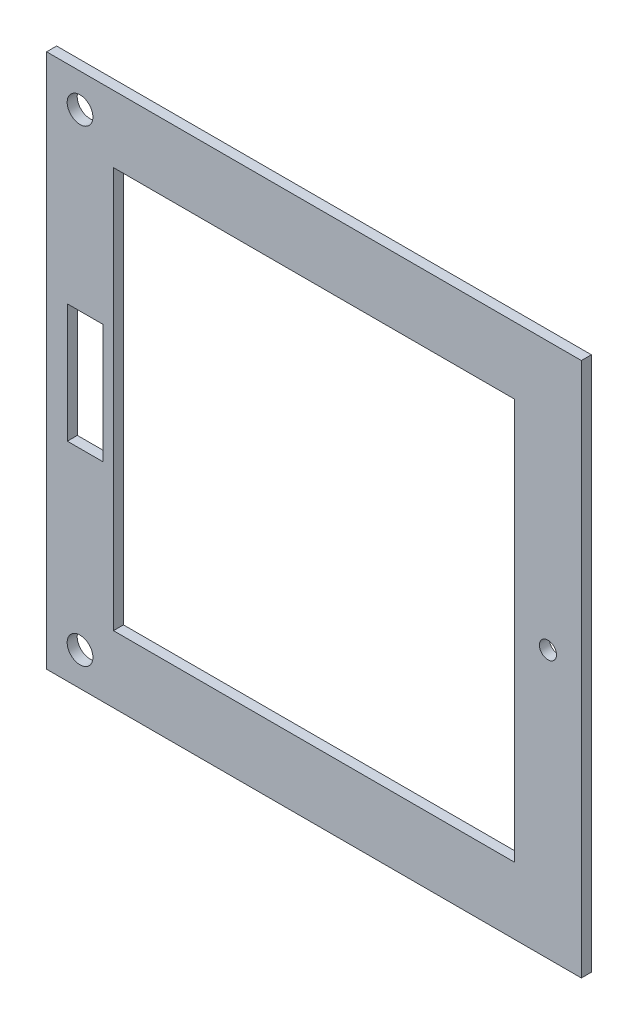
ISO-10303-21;
HEADER;
FILE_DESCRIPTION(('STEP AP214'),'2;1');
FILE_NAME('part.step','',(''),(''),'','','');
FILE_SCHEMA(('AUTOMOTIVE_DESIGN { 1 0 10303 214 1 1 1 1 }'));
ENDSEC;
DATA;
#1=APPLICATION_CONTEXT('core data for automotive mechanical design processes');
#2=APPLICATION_PROTOCOL_DEFINITION('international standard','automotive_design',2000,#1);
#3=PRODUCT_CONTEXT('',#1,'mechanical');
#4=PRODUCT('Part','Part','',(#3));
#5=PRODUCT_RELATED_PRODUCT_CATEGORY('part','',(#4));
#6=PRODUCT_DEFINITION_FORMATION('','',#4);
#7=PRODUCT_DEFINITION_CONTEXT('part definition',#1,'design');
#8=PRODUCT_DEFINITION('design','',#6,#7);
#9=PRODUCT_DEFINITION_SHAPE('','',#8);
#10=(LENGTH_UNIT() NAMED_UNIT(*) SI_UNIT(.MILLI.,.METRE.));
#11=(NAMED_UNIT(*) PLANE_ANGLE_UNIT() SI_UNIT($,.RADIAN.));
#12=(NAMED_UNIT(*) SI_UNIT($,.STERADIAN.) SOLID_ANGLE_UNIT());
#13=UNCERTAINTY_MEASURE_WITH_UNIT(LENGTH_MEASURE(1.E-05),#10,'distance_accuracy_value','');
#14=(GEOMETRIC_REPRESENTATION_CONTEXT(3) GLOBAL_UNCERTAINTY_ASSIGNED_CONTEXT((#13)) GLOBAL_UNIT_ASSIGNED_CONTEXT((#10,
#11,#12)) REPRESENTATION_CONTEXT('',''));
#15=CARTESIAN_POINT('',(0.,0.,0.));
#16=DIRECTION('',(0.,0.,1.));
#17=DIRECTION('',(1.,0.,0.));
#18=AXIS2_PLACEMENT_3D('',#15,#16,#17);
#19=CARTESIAN_POINT('',(0.,0.,6.));
#20=DIRECTION('',(0.,0.,-1.));
#21=DIRECTION('',(-1.,0.,0.));
#22=AXIS2_PLACEMENT_3D('',#19,#20,#21);
#23=PLANE('',#22);
#24=DIRECTION('',(1.,0.,0.));
#25=VECTOR('',#24,1.);
#26=CARTESIAN_POINT('',(-27.6,84.4,6.));
#27=LINE('',#26,#25);
#28=CARTESIAN_POINT('',(-27.6,84.4,6.));
#29=VERTEX_POINT('',#28);
#30=CARTESIAN_POINT('',(-6.40000000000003,84.4,6.));
#31=VERTEX_POINT('',#30);
#32=EDGE_CURVE('E149',#29,#31,#27,.T.);
#33=ORIENTED_EDGE('',*,*,#32,.F.);
#34=DIRECTION('',(0.,-1.,0.));
#35=VECTOR('',#34,1.);
#36=CARTESIAN_POINT('',(-27.6,155.6,6.));
#37=LINE('',#36,#35);
#38=CARTESIAN_POINT('',(-27.6,155.6,6.));
#39=VERTEX_POINT('',#38);
#40=EDGE_CURVE('E48',#39,#29,#37,.T.);
#41=ORIENTED_EDGE('',*,*,#40,.F.);
#42=DIRECTION('',(-1.,0.,0.));
#43=VECTOR('',#42,1.);
#44=CARTESIAN_POINT('',(-27.6,155.6,6.));
#45=LINE('',#44,#43);
#46=CARTESIAN_POINT('',(-6.40000000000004,155.6,6.));
#47=VERTEX_POINT('',#46);
#48=EDGE_CURVE('E140',#47,#39,#45,.T.);
#49=ORIENTED_EDGE('',*,*,#48,.F.);
#50=DIRECTION('',(0.,1.,0.));
#51=VECTOR('',#50,1.);
#52=CARTESIAN_POINT('',(-6.40000000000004,155.6,6.));
#53=LINE('',#52,#51);
#54=EDGE_CURVE('E143',#31,#47,#53,.T.);
#55=ORIENTED_EDGE('',*,*,#54,.F.);
#56=EDGE_LOOP('',(#33,#41,#49,#55));
#57=FACE_BOUND('',#56,.T.);
#58=CARTESIAN_POINT('',(-20.,-20.,6.));
#59=DIRECTION('',(0.,0.,1.));
#60=DIRECTION('',(1.,0.,0.));
#61=AXIS2_PLACEMENT_3D('',#58,#59,#60);
#62=CIRCLE('',#61,7.7);
#63=CARTESIAN_POINT('',(-12.3,-20.,6.));
#64=VERTEX_POINT('',#63);
#65=EDGE_CURVE('E155',#64,#64,#62,.T.);
#66=ORIENTED_EDGE('',*,*,#65,.F.);
#67=EDGE_LOOP('',(#66));
#68=FACE_BOUND('',#67,.T.);
#69=CARTESIAN_POINT('',(260.,120.,6.));
#70=DIRECTION('',(0.,0.,1.));
#71=DIRECTION('',(1.,0.,0.));
#72=AXIS2_PLACEMENT_3D('',#69,#70,#71);
#73=CIRCLE('',#72,5.09999999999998);
#74=CARTESIAN_POINT('',(265.1,120.,6.));
#75=VERTEX_POINT('',#74);
#76=EDGE_CURVE('E162',#75,#75,#73,.T.);
#77=ORIENTED_EDGE('',*,*,#76,.F.);
#78=EDGE_LOOP('',(#77));
#79=FACE_BOUND('',#78,.T.);
#80=CARTESIAN_POINT('',(-20.,260.,6.));
#81=DIRECTION('',(0.,0.,1.));
#82=DIRECTION('',(1.,0.,0.));
#83=AXIS2_PLACEMENT_3D('',#80,#81,#82);
#84=CIRCLE('',#83,7.69999999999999);
#85=CARTESIAN_POINT('',(-12.3,260.,6.));
#86=VERTEX_POINT('',#85);
#87=EDGE_CURVE('E168',#86,#86,#84,.T.);
#88=ORIENTED_EDGE('',*,*,#87,.F.);
#89=EDGE_LOOP('',(#88));
#90=FACE_BOUND('',#89,.T.);
#91=DIRECTION('',(0.,-1.,0.));
#92=VECTOR('',#91,1.);
#93=CARTESIAN_POINT('',(-40.,-40.,6.));
#94=LINE('',#93,#92);
#95=CARTESIAN_POINT('',(-40.,280.,6.));
#96=VERTEX_POINT('',#95);
#97=CARTESIAN_POINT('',(-40.,-40.,6.));
#98=VERTEX_POINT('',#97);
#99=EDGE_CURVE('E208',#96,#98,#94,.T.);
#100=ORIENTED_EDGE('',*,*,#99,.T.);
#101=DIRECTION('',(1.,0.,0.));
#102=VECTOR('',#101,1.);
#103=CARTESIAN_POINT('',(-40.,-40.,6.));
#104=LINE('',#103,#102);
#105=CARTESIAN_POINT('',(280.,-40.,6.));
#106=VERTEX_POINT('',#105);
#107=EDGE_CURVE('E211',#98,#106,#104,.T.);
#108=ORIENTED_EDGE('',*,*,#107,.T.);
#109=DIRECTION('',(0.,1.,0.));
#110=VECTOR('',#109,1.);
#111=CARTESIAN_POINT('',(280.,-40.,6.));
#112=LINE('',#111,#110);
#113=CARTESIAN_POINT('',(280.,280.,6.));
#114=VERTEX_POINT('',#113);
#115=EDGE_CURVE('E214',#106,#114,#112,.T.);
#116=ORIENTED_EDGE('',*,*,#115,.T.);
#117=DIRECTION('',(-1.,0.,0.));
#118=VECTOR('',#117,1.);
#119=CARTESIAN_POINT('',(-40.,280.,6.));
#120=LINE('',#119,#118);
#121=EDGE_CURVE('E216',#114,#96,#120,.T.);
#122=ORIENTED_EDGE('',*,*,#121,.T.);
#123=EDGE_LOOP('',(#100,#108,#116,#122));
#124=FACE_BOUND('',#123,.T.);
#125=DIRECTION('',(0.,-1.,0.));
#126=VECTOR('',#125,1.);
#127=CARTESIAN_POINT('',(0.,0.,6.));
#128=LINE('',#127,#126);
#129=CARTESIAN_POINT('',(0.,240.,6.));
#130=VERTEX_POINT('',#129);
#131=CARTESIAN_POINT('',(0.,0.,6.));
#132=VERTEX_POINT('',#131);
#133=EDGE_CURVE('E177',#130,#132,#128,.T.);
#134=ORIENTED_EDGE('',*,*,#133,.F.);
#135=DIRECTION('',(-1.,0.,0.));
#136=VECTOR('',#135,1.);
#137=CARTESIAN_POINT('',(0.,240.,6.));
#138=LINE('',#137,#136);
#139=CARTESIAN_POINT('',(240.,240.,6.));
#140=VERTEX_POINT('',#139);
#141=EDGE_CURVE('E185',#140,#130,#138,.T.);
#142=ORIENTED_EDGE('',*,*,#141,.F.);
#143=DIRECTION('',(0.,1.,0.));
#144=VECTOR('',#143,1.);
#145=CARTESIAN_POINT('',(240.,0.,6.));
#146=LINE('',#145,#144);
#147=CARTESIAN_POINT('',(240.,0.,6.));
#148=VERTEX_POINT('',#147);
#149=EDGE_CURVE('E182',#148,#140,#146,.T.);
#150=ORIENTED_EDGE('',*,*,#149,.F.);
#151=DIRECTION('',(1.,0.,0.));
#152=VECTOR('',#151,1.);
#153=CARTESIAN_POINT('',(0.,0.,6.));
#154=LINE('',#153,#152);
#155=EDGE_CURVE('E179',#132,#148,#154,.T.);
#156=ORIENTED_EDGE('',*,*,#155,.F.);
#157=EDGE_LOOP('',(#134,#142,#150,#156));
#158=FACE_BOUND('',#157,.T.);
#159=ADVANCED_FACE('F33',(#57,#68,#79,#90,#124,#158),#23,.F.);
#160=CARTESIAN_POINT('',(0.,0.,0.));
#161=DIRECTION('',(0.,0.,-1.));
#162=DIRECTION('',(-1.,0.,0.));
#163=AXIS2_PLACEMENT_3D('',#160,#161,#162);
#164=PLANE('',#163);
#165=DIRECTION('',(0.,-1.,0.));
#166=VECTOR('',#165,1.);
#167=CARTESIAN_POINT('',(-27.6,155.6,0.));
#168=LINE('',#167,#166);
#169=CARTESIAN_POINT('',(-27.6,155.6,0.));
#170=VERTEX_POINT('',#169);
#171=CARTESIAN_POINT('',(-27.6,84.4,0.));
#172=VERTEX_POINT('',#171);
#173=EDGE_CURVE('E124',#170,#172,#168,.T.);
#174=ORIENTED_EDGE('',*,*,#173,.T.);
#175=DIRECTION('',(1.,0.,0.));
#176=VECTOR('',#175,1.);
#177=CARTESIAN_POINT('',(-27.6,84.4,0.));
#178=LINE('',#177,#176);
#179=CARTESIAN_POINT('',(-6.40000000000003,84.4,0.));
#180=VERTEX_POINT('',#179);
#181=EDGE_CURVE('E133',#172,#180,#178,.T.);
#182=ORIENTED_EDGE('',*,*,#181,.T.);
#183=DIRECTION('',(0.,1.,0.));
#184=VECTOR('',#183,1.);
#185=CARTESIAN_POINT('',(-6.40000000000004,155.6,0.));
#186=LINE('',#185,#184);
#187=CARTESIAN_POINT('',(-6.40000000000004,155.6,0.));
#188=VERTEX_POINT('',#187);
#189=EDGE_CURVE('E56',#180,#188,#186,.T.);
#190=ORIENTED_EDGE('',*,*,#189,.T.);
#191=DIRECTION('',(-1.,0.,0.));
#192=VECTOR('',#191,1.);
#193=CARTESIAN_POINT('',(-27.6,155.6,0.));
#194=LINE('',#193,#192);
#195=EDGE_CURVE('E130',#188,#170,#194,.T.);
#196=ORIENTED_EDGE('',*,*,#195,.T.);
#197=EDGE_LOOP('',(#174,#182,#190,#196));
#198=FACE_BOUND('',#197,.T.);
#199=CARTESIAN_POINT('',(-20.,-20.,0.));
#200=DIRECTION('',(0.,0.,1.));
#201=DIRECTION('',(1.,0.,0.));
#202=AXIS2_PLACEMENT_3D('',#199,#200,#201);
#203=CIRCLE('',#202,7.7);
#204=CARTESIAN_POINT('',(-12.3,-20.,0.));
#205=VERTEX_POINT('',#204);
#206=EDGE_CURVE('E159',#205,#205,#203,.T.);
#207=ORIENTED_EDGE('',*,*,#206,.T.);
#208=EDGE_LOOP('',(#207));
#209=FACE_BOUND('',#208,.T.);
#210=CARTESIAN_POINT('',(260.,120.,0.));
#211=DIRECTION('',(0.,0.,1.));
#212=DIRECTION('',(1.,0.,0.));
#213=AXIS2_PLACEMENT_3D('',#210,#211,#212);
#214=CIRCLE('',#213,5.09999999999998);
#215=CARTESIAN_POINT('',(265.1,120.,0.));
#216=VERTEX_POINT('',#215);
#217=EDGE_CURVE('E165',#216,#216,#214,.T.);
#218=ORIENTED_EDGE('',*,*,#217,.T.);
#219=EDGE_LOOP('',(#218));
#220=FACE_BOUND('',#219,.T.);
#221=CARTESIAN_POINT('',(-20.,260.,0.));
#222=DIRECTION('',(0.,0.,1.));
#223=DIRECTION('',(1.,0.,0.));
#224=AXIS2_PLACEMENT_3D('',#221,#222,#223);
#225=CIRCLE('',#224,7.69999999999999);
#226=CARTESIAN_POINT('',(-12.3,260.,0.));
#227=VERTEX_POINT('',#226);
#228=EDGE_CURVE('E171',#227,#227,#225,.T.);
#229=ORIENTED_EDGE('',*,*,#228,.T.);
#230=EDGE_LOOP('',(#229));
#231=FACE_BOUND('',#230,.T.);
#232=DIRECTION('',(0.,-1.,0.));
#233=VECTOR('',#232,1.);
#234=CARTESIAN_POINT('',(-40.,-40.,0.));
#235=LINE('',#234,#233);
#236=CARTESIAN_POINT('',(-40.,280.,0.));
#237=VERTEX_POINT('',#236);
#238=CARTESIAN_POINT('',(-40.,-40.,0.));
#239=VERTEX_POINT('',#238);
#240=EDGE_CURVE('E207',#237,#239,#235,.T.);
#241=ORIENTED_EDGE('',*,*,#240,.F.);
#242=DIRECTION('',(-1.,0.,0.));
#243=VECTOR('',#242,1.);
#244=CARTESIAN_POINT('',(-40.,280.,0.));
#245=LINE('',#244,#243);
#246=CARTESIAN_POINT('',(280.,280.,0.));
#247=VERTEX_POINT('',#246);
#248=EDGE_CURVE('E212',#247,#237,#245,.T.);
#249=ORIENTED_EDGE('',*,*,#248,.F.);
#250=DIRECTION('',(0.,1.,0.));
#251=VECTOR('',#250,1.);
#252=CARTESIAN_POINT('',(280.,-40.,0.));
#253=LINE('',#252,#251);
#254=CARTESIAN_POINT('',(280.,-40.,0.));
#255=VERTEX_POINT('',#254);
#256=EDGE_CURVE('E223',#255,#247,#253,.T.);
#257=ORIENTED_EDGE('',*,*,#256,.F.);
#258=DIRECTION('',(1.,0.,0.));
#259=VECTOR('',#258,1.);
#260=CARTESIAN_POINT('',(-40.,-40.,0.));
#261=LINE('',#260,#259);
#262=EDGE_CURVE('E221',#239,#255,#261,.T.);
#263=ORIENTED_EDGE('',*,*,#262,.F.);
#264=EDGE_LOOP('',(#241,#249,#257,#263));
#265=FACE_BOUND('',#264,.T.);
#266=DIRECTION('',(-1.,0.,0.));
#267=VECTOR('',#266,1.);
#268=CARTESIAN_POINT('',(0.,240.,0.));
#269=LINE('',#268,#267);
#270=CARTESIAN_POINT('',(240.,240.,0.));
#271=VERTEX_POINT('',#270);
#272=CARTESIAN_POINT('',(0.,240.,0.));
#273=VERTEX_POINT('',#272);
#274=EDGE_CURVE('E180',#271,#273,#269,.T.);
#275=ORIENTED_EDGE('',*,*,#274,.T.);
#276=DIRECTION('',(0.,-1.,0.));
#277=VECTOR('',#276,1.);
#278=CARTESIAN_POINT('',(0.,0.,0.));
#279=LINE('',#278,#277);
#280=CARTESIAN_POINT('',(0.,0.,0.));
#281=VERTEX_POINT('',#280);
#282=EDGE_CURVE('E174',#273,#281,#279,.T.);
#283=ORIENTED_EDGE('',*,*,#282,.T.);
#284=DIRECTION('',(1.,0.,0.));
#285=VECTOR('',#284,1.);
#286=CARTESIAN_POINT('',(0.,0.,0.));
#287=LINE('',#286,#285);
#288=CARTESIAN_POINT('',(240.,0.,0.));
#289=VERTEX_POINT('',#288);
#290=EDGE_CURVE('E190',#281,#289,#287,.T.);
#291=ORIENTED_EDGE('',*,*,#290,.T.);
#292=DIRECTION('',(0.,1.,0.));
#293=VECTOR('',#292,1.);
#294=CARTESIAN_POINT('',(240.,0.,0.));
#295=LINE('',#294,#293);
#296=EDGE_CURVE('E193',#289,#271,#295,.T.);
#297=ORIENTED_EDGE('',*,*,#296,.T.);
#298=EDGE_LOOP('',(#275,#283,#291,#297));
#299=FACE_BOUND('',#298,.T.);
#300=ADVANCED_FACE('F137',(#198,#209,#220,#231,#265,#299),#164,.T.);
#301=CARTESIAN_POINT('',(-40.,-40.,6.));
#302=DIRECTION('',(1.,0.,0.));
#303=DIRECTION('',(0.,0.,-1.));
#304=AXIS2_PLACEMENT_3D('',#301,#302,#303);
#305=PLANE('',#304);
#306=ORIENTED_EDGE('',*,*,#240,.T.);
#307=DIRECTION('',(0.,0.,-1.));
#308=VECTOR('',#307,1.);
#309=CARTESIAN_POINT('',(-40.,-40.,6.));
#310=LINE('',#309,#308);
#311=EDGE_CURVE('E11',#98,#239,#310,.T.);
#312=ORIENTED_EDGE('',*,*,#311,.F.);
#313=ORIENTED_EDGE('',*,*,#99,.F.);
#314=DIRECTION('',(0.,0.,-1.));
#315=VECTOR('',#314,1.);
#316=CARTESIAN_POINT('',(-40.,280.,6.));
#317=LINE('',#316,#315);
#318=EDGE_CURVE('E218',#96,#237,#317,.T.);
#319=ORIENTED_EDGE('',*,*,#318,.T.);
#320=EDGE_LOOP('',(#306,#312,#313,#319));
#321=FACE_BOUND('',#320,.T.);
#322=ADVANCED_FACE('F35',(#321),#305,.F.);
#323=CARTESIAN_POINT('',(-40.,-40.,6.));
#324=DIRECTION('',(0.,1.,0.));
#325=DIRECTION('',(0.,0.,1.));
#326=AXIS2_PLACEMENT_3D('',#323,#324,#325);
#327=PLANE('',#326);
#328=ORIENTED_EDGE('',*,*,#262,.T.);
#329=DIRECTION('',(0.,0.,-1.));
#330=VECTOR('',#329,1.);
#331=CARTESIAN_POINT('',(280.,-40.,6.));
#332=LINE('',#331,#330);
#333=EDGE_CURVE('E41',#106,#255,#332,.T.);
#334=ORIENTED_EDGE('',*,*,#333,.F.);
#335=ORIENTED_EDGE('',*,*,#107,.F.);
#336=ORIENTED_EDGE('',*,*,#311,.T.);
#337=EDGE_LOOP('',(#328,#334,#335,#336));
#338=FACE_BOUND('',#337,.T.);
#339=ADVANCED_FACE('F251',(#338),#327,.F.);
#340=CARTESIAN_POINT('',(280.,-40.,6.));
#341=DIRECTION('',(-1.,0.,0.));
#342=DIRECTION('',(0.,0.,1.));
#343=AXIS2_PLACEMENT_3D('',#340,#341,#342);
#344=PLANE('',#343);
#345=ORIENTED_EDGE('',*,*,#256,.T.);
#346=DIRECTION('',(0.,0.,-1.));
#347=VECTOR('',#346,1.);
#348=CARTESIAN_POINT('',(280.,280.,6.));
#349=LINE('',#348,#347);
#350=EDGE_CURVE('E228',#114,#247,#349,.T.);
#351=ORIENTED_EDGE('',*,*,#350,.F.);
#352=ORIENTED_EDGE('',*,*,#115,.F.);
#353=ORIENTED_EDGE('',*,*,#333,.T.);
#354=EDGE_LOOP('',(#345,#351,#352,#353));
#355=FACE_BOUND('',#354,.T.);
#356=ADVANCED_FACE('F235',(#355),#344,.F.);
#357=CARTESIAN_POINT('',(-40.,280.,6.));
#358=DIRECTION('',(0.,-1.,0.));
#359=DIRECTION('',(0.,0.,-1.));
#360=AXIS2_PLACEMENT_3D('',#357,#358,#359);
#361=PLANE('',#360);
#362=ORIENTED_EDGE('',*,*,#248,.T.);
#363=ORIENTED_EDGE('',*,*,#318,.F.);
#364=ORIENTED_EDGE('',*,*,#121,.F.);
#365=ORIENTED_EDGE('',*,*,#350,.T.);
#366=EDGE_LOOP('',(#362,#363,#364,#365));
#367=FACE_BOUND('',#366,.T.);
#368=ADVANCED_FACE('F244',(#367),#361,.F.);
#369=CARTESIAN_POINT('',(0.,0.,6.));
#370=DIRECTION('',(1.,0.,0.));
#371=DIRECTION('',(0.,0.,-1.));
#372=AXIS2_PLACEMENT_3D('',#369,#370,#371);
#373=PLANE('',#372);
#374=ORIENTED_EDGE('',*,*,#282,.F.);
#375=DIRECTION('',(0.,0.,-1.));
#376=VECTOR('',#375,1.);
#377=CARTESIAN_POINT('',(0.,240.,6.));
#378=LINE('',#377,#376);
#379=EDGE_CURVE('E187',#130,#273,#378,.T.);
#380=ORIENTED_EDGE('',*,*,#379,.F.);
#381=ORIENTED_EDGE('',*,*,#133,.T.);
#382=DIRECTION('',(0.,0.,-1.));
#383=VECTOR('',#382,1.);
#384=CARTESIAN_POINT('',(0.,0.,6.));
#385=LINE('',#384,#383);
#386=EDGE_CURVE('E204',#132,#281,#385,.T.);
#387=ORIENTED_EDGE('',*,*,#386,.T.);
#388=EDGE_LOOP('',(#374,#380,#381,#387));
#389=FACE_BOUND('',#388,.T.);
#390=ADVANCED_FACE('F267',(#389),#373,.T.);
#391=CARTESIAN_POINT('',(0.,0.,6.));
#392=DIRECTION('',(0.,1.,0.));
#393=DIRECTION('',(0.,0.,1.));
#394=AXIS2_PLACEMENT_3D('',#391,#392,#393);
#395=PLANE('',#394);
#396=ORIENTED_EDGE('',*,*,#290,.F.);
#397=ORIENTED_EDGE('',*,*,#386,.F.);
#398=ORIENTED_EDGE('',*,*,#155,.T.);
#399=DIRECTION('',(0.,0.,-1.));
#400=VECTOR('',#399,1.);
#401=CARTESIAN_POINT('',(240.,0.,6.));
#402=LINE('',#401,#400);
#403=EDGE_CURVE('E202',#148,#289,#402,.T.);
#404=ORIENTED_EDGE('',*,*,#403,.T.);
#405=EDGE_LOOP('',(#396,#397,#398,#404));
#406=FACE_BOUND('',#405,.T.);
#407=ADVANCED_FACE('F274',(#406),#395,.T.);
#408=CARTESIAN_POINT('',(240.,0.,6.));
#409=DIRECTION('',(-1.,0.,0.));
#410=DIRECTION('',(0.,0.,1.));
#411=AXIS2_PLACEMENT_3D('',#408,#409,#410);
#412=PLANE('',#411);
#413=ORIENTED_EDGE('',*,*,#296,.F.);
#414=ORIENTED_EDGE('',*,*,#403,.F.);
#415=ORIENTED_EDGE('',*,*,#149,.T.);
#416=DIRECTION('',(0.,0.,-1.));
#417=VECTOR('',#416,1.);
#418=CARTESIAN_POINT('',(240.,240.,6.));
#419=LINE('',#418,#417);
#420=EDGE_CURVE('E200',#140,#271,#419,.T.);
#421=ORIENTED_EDGE('',*,*,#420,.T.);
#422=EDGE_LOOP('',(#413,#414,#415,#421));
#423=FACE_BOUND('',#422,.T.);
#424=ADVANCED_FACE('F279',(#423),#412,.T.);
#425=CARTESIAN_POINT('',(0.,240.,6.));
#426=DIRECTION('',(0.,-1.,0.));
#427=DIRECTION('',(0.,0.,-1.));
#428=AXIS2_PLACEMENT_3D('',#425,#426,#427);
#429=PLANE('',#428);
#430=ORIENTED_EDGE('',*,*,#274,.F.);
#431=ORIENTED_EDGE('',*,*,#420,.F.);
#432=ORIENTED_EDGE('',*,*,#141,.T.);
#433=ORIENTED_EDGE('',*,*,#379,.T.);
#434=EDGE_LOOP('',(#430,#431,#432,#433));
#435=FACE_BOUND('',#434,.T.);
#436=ADVANCED_FACE('F286',(#435),#429,.T.);
#437=CARTESIAN_POINT('',(-20.,260.,0.));
#438=DIRECTION('',(0.,0.,1.));
#439=DIRECTION('',(1.,0.,0.));
#440=AXIS2_PLACEMENT_3D('',#437,#438,#439);
#441=CYLINDRICAL_SURFACE('',#440,7.69999999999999);
#442=ORIENTED_EDGE('',*,*,#228,.F.);
#443=EDGE_LOOP('',(#442));
#444=FACE_BOUND('',#443,.T.);
#445=ORIENTED_EDGE('',*,*,#87,.T.);
#446=EDGE_LOOP('',(#445));
#447=FACE_BOUND('',#446,.T.);
#448=ADVANCED_FACE('F298',(#444,#447),#441,.F.);
#449=CARTESIAN_POINT('',(260.,120.,0.));
#450=DIRECTION('',(0.,0.,1.));
#451=DIRECTION('',(1.,0.,0.));
#452=AXIS2_PLACEMENT_3D('',#449,#450,#451);
#453=CYLINDRICAL_SURFACE('',#452,5.09999999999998);
#454=ORIENTED_EDGE('',*,*,#217,.F.);
#455=EDGE_LOOP('',(#454));
#456=FACE_BOUND('',#455,.T.);
#457=ORIENTED_EDGE('',*,*,#76,.T.);
#458=EDGE_LOOP('',(#457));
#459=FACE_BOUND('',#458,.T.);
#460=ADVANCED_FACE('F303',(#456,#459),#453,.F.);
#461=CARTESIAN_POINT('',(-20.,-20.,0.));
#462=DIRECTION('',(0.,0.,1.));
#463=DIRECTION('',(1.,0.,0.));
#464=AXIS2_PLACEMENT_3D('',#461,#462,#463);
#465=CYLINDRICAL_SURFACE('',#464,7.7);
#466=ORIENTED_EDGE('',*,*,#206,.F.);
#467=EDGE_LOOP('',(#466));
#468=FACE_BOUND('',#467,.T.);
#469=ORIENTED_EDGE('',*,*,#65,.T.);
#470=EDGE_LOOP('',(#469));
#471=FACE_BOUND('',#470,.T.);
#472=ADVANCED_FACE('F307',(#468,#471),#465,.F.);
#473=CARTESIAN_POINT('',(-27.6,155.6,0.));
#474=DIRECTION('',(-1.,0.,0.));
#475=DIRECTION('',(0.,-1.,0.));
#476=AXIS2_PLACEMENT_3D('',#473,#474,#475);
#477=PLANE('',#476);
#478=ORIENTED_EDGE('',*,*,#40,.T.);
#479=DIRECTION('',(0.,0.,1.));
#480=VECTOR('',#479,1.);
#481=CARTESIAN_POINT('',(-27.6,84.4,0.));
#482=LINE('',#481,#480);
#483=EDGE_CURVE('E120',#172,#29,#482,.T.);
#484=ORIENTED_EDGE('',*,*,#483,.F.);
#485=ORIENTED_EDGE('',*,*,#173,.F.);
#486=DIRECTION('',(0.,0.,1.));
#487=VECTOR('',#486,1.);
#488=CARTESIAN_POINT('',(-27.6,155.6,0.));
#489=LINE('',#488,#487);
#490=EDGE_CURVE('E153',#170,#39,#489,.T.);
#491=ORIENTED_EDGE('',*,*,#490,.T.);
#492=EDGE_LOOP('',(#478,#484,#485,#491));
#493=FACE_BOUND('',#492,.T.);
#494=ADVANCED_FACE('F122',(#493),#477,.F.);
#495=CARTESIAN_POINT('',(-27.6,155.6,0.));
#496=DIRECTION('',(0.,1.,0.));
#497=DIRECTION('',(0.,0.,1.));
#498=AXIS2_PLACEMENT_3D('',#495,#496,#497);
#499=PLANE('',#498);
#500=ORIENTED_EDGE('',*,*,#48,.T.);
#501=ORIENTED_EDGE('',*,*,#490,.F.);
#502=ORIENTED_EDGE('',*,*,#195,.F.);
#503=DIRECTION('',(0.,0.,1.));
#504=VECTOR('',#503,1.);
#505=CARTESIAN_POINT('',(-6.40000000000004,155.6,0.));
#506=LINE('',#505,#504);
#507=EDGE_CURVE('E156',#188,#47,#506,.T.);
#508=ORIENTED_EDGE('',*,*,#507,.T.);
#509=EDGE_LOOP('',(#500,#501,#502,#508));
#510=FACE_BOUND('',#509,.T.);
#511=ADVANCED_FACE('F314',(#510),#499,.F.);
#512=CARTESIAN_POINT('',(-6.40000000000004,155.6,0.));
#513=DIRECTION('',(1.,0.,0.));
#514=DIRECTION('',(0.,1.,0.));
#515=AXIS2_PLACEMENT_3D('',#512,#513,#514);
#516=PLANE('',#515);
#517=ORIENTED_EDGE('',*,*,#54,.T.);
#518=ORIENTED_EDGE('',*,*,#507,.F.);
#519=ORIENTED_EDGE('',*,*,#189,.F.);
#520=DIRECTION('',(0.,0.,1.));
#521=VECTOR('',#520,1.);
#522=CARTESIAN_POINT('',(-6.40000000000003,84.4,0.));
#523=LINE('',#522,#521);
#524=EDGE_CURVE('E129',#180,#31,#523,.T.);
#525=ORIENTED_EDGE('',*,*,#524,.T.);
#526=EDGE_LOOP('',(#517,#518,#519,#525));
#527=FACE_BOUND('',#526,.T.);
#528=ADVANCED_FACE('F317',(#527),#516,.F.);
#529=CARTESIAN_POINT('',(-27.6,84.4,0.));
#530=DIRECTION('',(0.,-1.,0.));
#531=DIRECTION('',(1.,0.,0.));
#532=AXIS2_PLACEMENT_3D('',#529,#530,#531);
#533=PLANE('',#532);
#534=ORIENTED_EDGE('',*,*,#32,.T.);
#535=ORIENTED_EDGE('',*,*,#524,.F.);
#536=ORIENTED_EDGE('',*,*,#181,.F.);
#537=ORIENTED_EDGE('',*,*,#483,.T.);
#538=EDGE_LOOP('',(#534,#535,#536,#537));
#539=FACE_BOUND('',#538,.T.);
#540=ADVANCED_FACE('F134',(#539),#533,.F.);
#541=CLOSED_SHELL('',(#159,#300,#322,#339,#356,#368,#390,#407,#424,#436,#448,#460,#472,#494,
#511,#528,#540));
#542=MANIFOLD_SOLID_BREP('B2',#541);
#543=ADVANCED_BREP_SHAPE_REPRESENTATION('',(#18,#542),#14);
#544=SHAPE_DEFINITION_REPRESENTATION(#9,#543);
ENDSEC;
END-ISO-10303-21;
